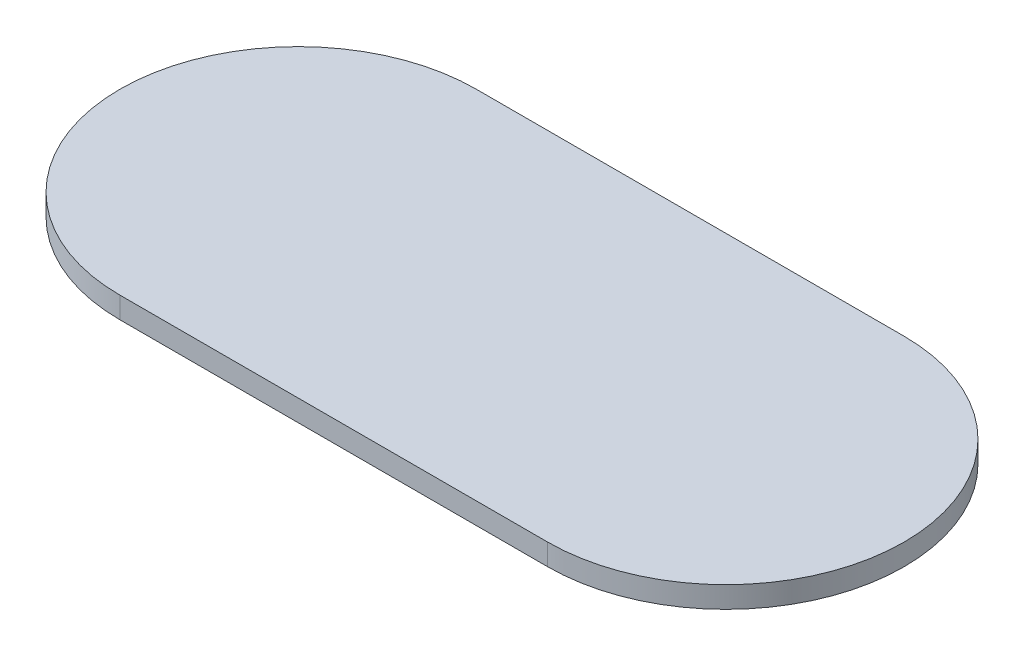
from build123d import *

# Parameters (mm, degrees)
BOSS_EXTRUDE1_DEPTH = 7.5


with BuildPart() as part:
    # Sketch1 → Boss-Extrude1 (new, symmetric)
    with BuildSketch(Plane(origin=(0, 0, 0), x_dir=(1, 0, 0), z_dir=(0, 1, 0))):
        with BuildLine():
            Line((-150, 125), (150, 125))
            ThreePointArc((150, 125), (275, 0), (150, -125))
            Line((150, -125), (-150, -125))
            ThreePointArc((-150, -125), (-275, 0), (-150, 125))
        make_face()
    extrude(amount=BOSS_EXTRUDE1_DEPTH, both=True)


solid = part.part
